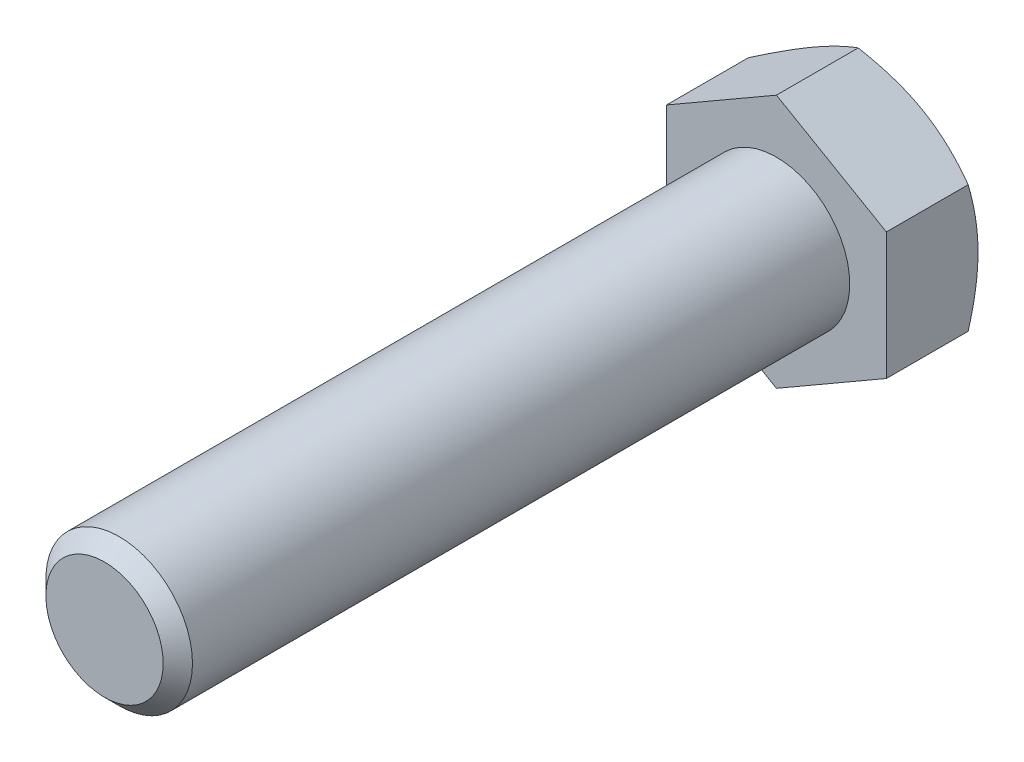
from build123d import *

# Parameters (mm, degrees)
ESQUISSE1_W        = 6
ESQUISSE1_H        = 55
CHANFREIN1_SIZE    = 1.2
BOSS_EXTRU_1_DEPTH = 7.5


with BuildPart() as part:
    # Esquisse1 → Base-R_volution (revolve)
    with BuildSketch(Plane(origin=(0, 0, 0), x_dir=(1, 0, 0), z_dir=(0, 1, 0))):
        with Locations((3, -27.5)):
            Rectangle(ESQUISSE1_W, ESQUISSE1_H)
    revolve(axis=Axis((0, 0, 0), (0, 0, 1)))

    # Chanfrein1
    chanfrein1_edges = [part.edges().sort_by_distance(p)[0] for p in [
        (-6, 0, 55),
    ]]
    chamfer(chanfrein1_edges, length=CHANFREIN1_SIZE)

    # Esquisse6 → Boss.-Extru.1 (add)
    with BuildSketch(Plane.XY):
        Polygon((9, -5.196152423), (9, 5.196152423), (0, 10.392304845), (-9, 5.196152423), (-9, -5.196152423), (0, -10.392304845), align=None)
    extrude(amount=-BOSS_EXTRU_1_DEPTH)

    # Esquisse7 → Enl_vement de mati_re-R_volution1 (revolve, cut)
    with BuildSketch(Plane(origin=(0, 0, 0), x_dir=(1, 0, 0), z_dir=(0, 1, 0))):
        Polygon((-9, 7.5), (-21.990381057, 7.5), (-21.990381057, 0), align=None)
    revolve(axis=Axis((0, 0, -6.239446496), (0, 0, 1)), mode=Mode.SUBTRACT)


solid = part.part
